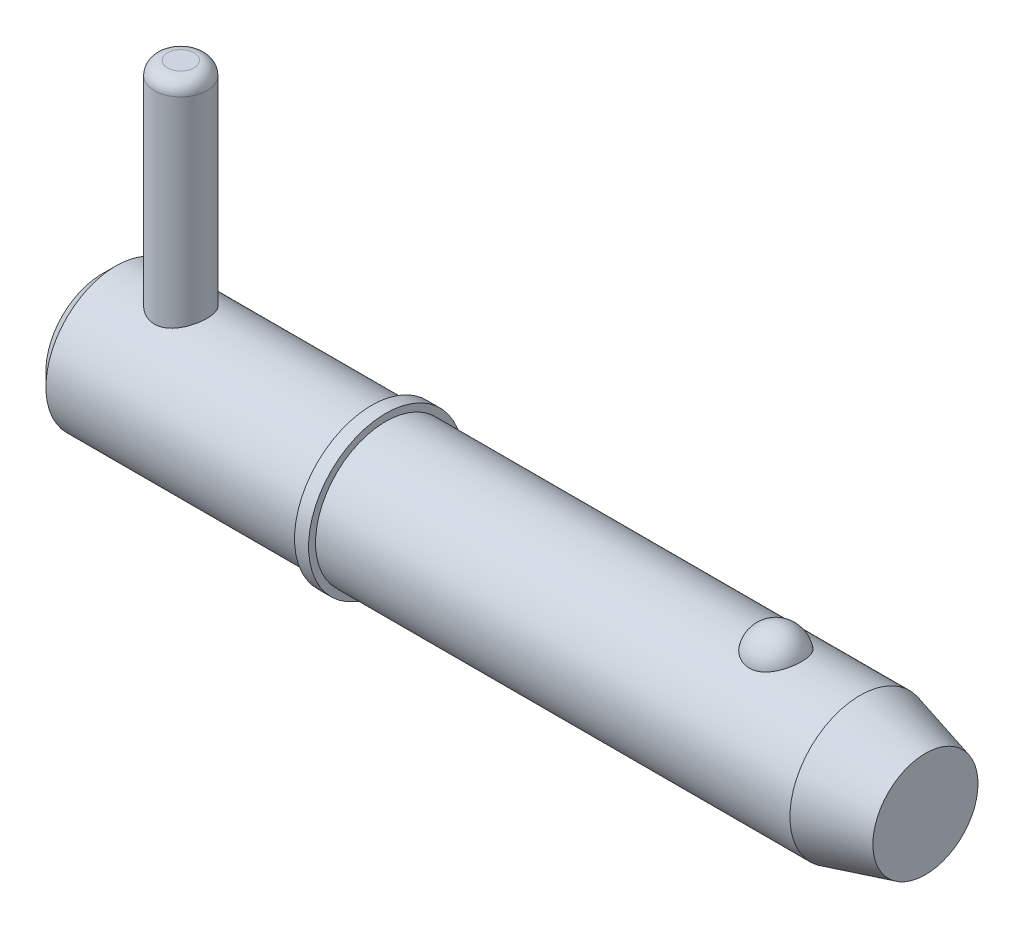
ISO-10303-21;
HEADER;
FILE_DESCRIPTION(('STEP AP214'),'2;1');
FILE_NAME('part.step','',(''),(''),'','','');
FILE_SCHEMA(('AUTOMOTIVE_DESIGN { 1 0 10303 214 1 1 1 1 }'));
ENDSEC;
DATA;
#1=APPLICATION_CONTEXT('core data for automotive mechanical design processes');
#2=APPLICATION_PROTOCOL_DEFINITION('international standard','automotive_design',2000,#1);
#3=PRODUCT_CONTEXT('',#1,'mechanical');
#4=PRODUCT('Part','Part','',(#3));
#5=PRODUCT_RELATED_PRODUCT_CATEGORY('part','',(#4));
#6=PRODUCT_DEFINITION_FORMATION('','',#4);
#7=PRODUCT_DEFINITION_CONTEXT('part definition',#1,'design');
#8=PRODUCT_DEFINITION('design','',#6,#7);
#9=PRODUCT_DEFINITION_SHAPE('','',#8);
#10=(LENGTH_UNIT() NAMED_UNIT(*) SI_UNIT(.MILLI.,.METRE.));
#11=(NAMED_UNIT(*) PLANE_ANGLE_UNIT() SI_UNIT($,.RADIAN.));
#12=(NAMED_UNIT(*) SI_UNIT($,.STERADIAN.) SOLID_ANGLE_UNIT());
#13=UNCERTAINTY_MEASURE_WITH_UNIT(LENGTH_MEASURE(1.E-05),#10,'distance_accuracy_value','');
#14=(GEOMETRIC_REPRESENTATION_CONTEXT(3) GLOBAL_UNCERTAINTY_ASSIGNED_CONTEXT((#13)) GLOBAL_UNIT_ASSIGNED_CONTEXT((#10,
#11,#12)) REPRESENTATION_CONTEXT('',''));
#15=CARTESIAN_POINT('',(0.,0.,0.));
#16=DIRECTION('',(0.,0.,1.));
#17=DIRECTION('',(1.,0.,0.));
#18=AXIS2_PLACEMENT_3D('',#15,#16,#17);
#19=CARTESIAN_POINT('',(7.14,25.4,0.));
#20=DIRECTION('',(0.,-1.,0.));
#21=DIRECTION('',(0.,0.,-1.));
#22=AXIS2_PLACEMENT_3D('',#19,#20,#21);
#23=CYLINDRICAL_SURFACE('',#22,2.38);
#24=CARTESIAN_POINT('',(7.14,-5.16,0.));
#25=DIRECTION('',(0.,1.,0.));
#26=DIRECTION('',(0.,0.,1.));
#27=AXIS2_PLACEMENT_3D('',#24,#25,#26);
#28=CIRCLE('',#27,2.38);
#29=CARTESIAN_POINT('',(7.14,-5.16,2.38));
#30=VERTEX_POINT('',#29);
#31=EDGE_CURVE('P0_E25',#30,#30,#28,.T.);
#32=ORIENTED_EDGE('',*,*,#31,.T.);
#33=EDGE_LOOP('',(#32));
#34=FACE_BOUND('',#33,.T.);
#35=CARTESIAN_POINT('',(7.14,24.21,0.));
#36=DIRECTION('',(0.,1.,0.));
#37=DIRECTION('',(0.,0.,1.));
#38=AXIS2_PLACEMENT_3D('',#35,#36,#37);
#39=CIRCLE('',#38,2.38);
#40=CARTESIAN_POINT('',(7.14,24.21,2.38));
#41=VERTEX_POINT('',#40);
#42=EDGE_CURVE('P0_E29',#41,#41,#39,.F.);
#43=ORIENTED_EDGE('',*,*,#42,.T.);
#44=EDGE_LOOP('',(#43));
#45=FACE_BOUND('',#44,.T.);
#46=ADVANCED_FACE('P0_F14',(#34,#45),#23,.T.);
#47=CARTESIAN_POINT('',(7.14,25.4,0.));
#48=DIRECTION('',(0.,1.,0.));
#49=DIRECTION('',(0.,0.,1.));
#50=AXIS2_PLACEMENT_3D('',#47,#48,#49);
#51=PLANE('',#50);
#52=CARTESIAN_POINT('',(7.14,25.4,0.));
#53=DIRECTION('',(0.,1.,0.));
#54=DIRECTION('',(0.,0.,1.));
#55=AXIS2_PLACEMENT_3D('',#52,#53,#54);
#56=CIRCLE('',#55,1.19);
#57=CARTESIAN_POINT('',(7.14,25.4,1.19));
#58=VERTEX_POINT('',#57);
#59=EDGE_CURVE('P0_E10',#58,#58,#56,.T.);
#60=ORIENTED_EDGE('',*,*,#59,.T.);
#61=EDGE_LOOP('',(#60));
#62=FACE_BOUND('',#61,.T.);
#63=ADVANCED_FACE('P0_F46',(#62),#51,.T.);
#64=CARTESIAN_POINT('',(7.14,-6.35,0.));
#65=DIRECTION('',(0.,1.,0.));
#66=DIRECTION('',(0.,0.,1.));
#67=AXIS2_PLACEMENT_3D('',#64,#65,#66);
#68=PLANE('',#67);
#69=CARTESIAN_POINT('',(7.14,-6.35,0.));
#70=DIRECTION('',(0.,1.,0.));
#71=DIRECTION('',(0.,0.,1.));
#72=AXIS2_PLACEMENT_3D('',#69,#70,#71);
#73=CIRCLE('',#72,1.19);
#74=CARTESIAN_POINT('',(7.14,-6.35,1.19));
#75=VERTEX_POINT('',#74);
#76=EDGE_CURVE('P0_E21',#75,#75,#73,.F.);
#77=ORIENTED_EDGE('',*,*,#76,.T.);
#78=EDGE_LOOP('',(#77));
#79=FACE_BOUND('',#78,.T.);
#80=ADVANCED_FACE('P0_F43',(#79),#68,.F.);
#81=CARTESIAN_POINT('',(7.14,-5.16,0.));
#82=DIRECTION('',(0.,1.,0.));
#83=DIRECTION('',(0.,0.,1.));
#84=AXIS2_PLACEMENT_3D('',#81,#82,#83);
#85=DEGENERATE_TOROIDAL_SURFACE('',#84,1.19,1.19,.T.);
#86=ORIENTED_EDGE('',*,*,#76,.F.);
#87=EDGE_LOOP('',(#86));
#88=FACE_BOUND('',#87,.T.);
#89=ORIENTED_EDGE('',*,*,#31,.F.);
#90=EDGE_LOOP('',(#89));
#91=FACE_BOUND('',#90,.T.);
#92=ADVANCED_FACE('P0_F38',(#88,#91),#85,.T.);
#93=CARTESIAN_POINT('',(7.14,24.21,0.));
#94=DIRECTION('',(0.,1.,0.));
#95=DIRECTION('',(0.,0.,1.));
#96=AXIS2_PLACEMENT_3D('',#93,#94,#95);
#97=DEGENERATE_TOROIDAL_SURFACE('',#96,1.19,1.19,.T.);
#98=ORIENTED_EDGE('',*,*,#42,.F.);
#99=EDGE_LOOP('',(#98));
#100=FACE_BOUND('',#99,.T.);
#101=ORIENTED_EDGE('',*,*,#59,.F.);
#102=EDGE_LOOP('',(#101));
#103=FACE_BOUND('',#102,.T.);
#104=ADVANCED_FACE('P0_F16',(#100,#103),#97,.T.);
#105=CLOSED_SHELL('',(#46,#63,#80,#92,#104));
#106=MANIFOLD_SOLID_BREP('P0_B1',#105);
#107=CARTESIAN_POINT('',(0.,0.,0.));
#108=DIRECTION('',(1.,0.,0.));
#109=DIRECTION('',(0.,0.,-1.));
#110=AXIS2_PLACEMENT_3D('',#107,#108,#109);
#111=CYLINDRICAL_SURFACE('',#110,6.35);
#112=CARTESIAN_POINT('',(68.6753693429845,0.,0.));
#113=DIRECTION('',(1.,0.,0.));
#114=DIRECTION('',(0.,0.,-1.));
#115=AXIS2_PLACEMENT_3D('',#112,#113,#114);
#116=CIRCLE('',#115,6.35);
#117=CARTESIAN_POINT('',(68.6753693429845,0.,-6.35));
#118=VERTEX_POINT('',#117);
#119=EDGE_CURVE('P1_E81',#118,#118,#116,.T.);
#120=ORIENTED_EDGE('',*,*,#119,.F.);
#121=EDGE_LOOP('',(#120));
#122=FACE_BOUND('',#121,.T.);
#123=CARTESIAN_POINT('',(25.7,0.,0.));
#124=DIRECTION('',(1.,0.,0.));
#125=DIRECTION('',(0.,0.,-1.));
#126=AXIS2_PLACEMENT_3D('',#123,#124,#125);
#127=CIRCLE('',#126,6.35);
#128=CARTESIAN_POINT('',(25.7,0.,-6.35));
#129=VERTEX_POINT('',#128);
#130=EDGE_CURVE('P1_E85',#129,#129,#127,.T.);
#131=ORIENTED_EDGE('',*,*,#130,.T.);
#132=EDGE_LOOP('',(#131));
#133=FACE_BOUND('',#132,.T.);
#134=CARTESIAN_POINT('',(61.0500214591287,5.87502187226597,2.40969251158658));
#135=CARTESIAN_POINT('',(60.9250305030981,5.87501645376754,2.40969773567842));
#136=CARTESIAN_POINT('',(60.8000806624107,5.87916061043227,2.39967292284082));
#137=CARTESIAN_POINT('',(60.5539091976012,5.89523112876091,2.35991730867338));
#138=CARTESIAN_POINT('',(60.4326863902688,5.90715499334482,2.33019283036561));
#139=CARTESIAN_POINT('',(60.1975170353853,5.93739567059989,2.25201402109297));
#140=CARTESIAN_POINT('',(60.0835602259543,5.95570321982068,2.2035868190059));
#141=CARTESIAN_POINT('',(59.86557352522,5.99672067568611,2.08937987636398));
#142=CARTESIAN_POINT('',(59.7615457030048,6.01943149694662,2.02359652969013));
#143=CARTESIAN_POINT('',(59.5629437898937,6.06760647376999,1.8742896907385));
#144=CARTESIAN_POINT('',(59.4687268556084,6.09313095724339,1.79031110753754));
#145=CARTESIAN_POINT('',(59.2952557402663,6.14375873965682,1.60800178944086));
#146=CARTESIAN_POINT('',(59.2160043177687,6.16886196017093,1.50966841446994));
#147=CARTESIAN_POINT('',(59.0708457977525,6.21724600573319,1.29645884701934));
#148=CARTESIAN_POINT('',(59.0056885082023,6.24039621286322,1.18104158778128));
#149=CARTESIAN_POINT('',(58.8947035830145,6.28117277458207,0.94035184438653));
#150=CARTESIAN_POINT('',(58.8488776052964,6.29879865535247,0.815078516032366));
#151=CARTESIAN_POINT('',(58.7770234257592,6.32692073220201,0.556494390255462));
#152=CARTESIAN_POINT('',(58.751249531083,6.33732517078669,0.423102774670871));
#153=CARTESIAN_POINT('',(58.7209885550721,6.34957673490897,0.153542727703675));
#154=CARTESIAN_POINT('',(58.7165009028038,6.35142408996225,0.0173743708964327));
#155=CARTESIAN_POINT('',(58.7288655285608,6.34638925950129,-0.253036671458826));
#156=CARTESIAN_POINT('',(58.7455949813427,6.33955731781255,-0.387285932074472));
#157=CARTESIAN_POINT('',(58.799843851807,6.31794129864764,-0.65085123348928));
#158=CARTESIAN_POINT('',(58.8373636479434,6.30315707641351,-0.780167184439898));
#159=CARTESIAN_POINT('',(58.932500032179,6.26711642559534,-1.03041949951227));
#160=CARTESIAN_POINT('',(58.990143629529,6.24585130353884,-1.1513443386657));
#161=CARTESIAN_POINT('',(59.1243522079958,6.19905619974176,-1.38129800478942));
#162=CARTESIAN_POINT('',(59.2009187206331,6.17352587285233,-1.49032586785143));
#163=CARTESIAN_POINT('',(59.3717538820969,6.12080227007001,-1.69393164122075));
#164=CARTESIAN_POINT('',(59.4661008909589,6.09360200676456,-1.78844209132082));
#165=CARTESIAN_POINT('',(59.6701196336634,6.0407043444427,-1.95970536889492));
#166=CARTESIAN_POINT('',(59.7797900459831,6.01500681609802,-2.03645972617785));
#167=CARTESIAN_POINT('',(60.0091876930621,5.96867714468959,-2.16845644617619));
#168=CARTESIAN_POINT('',(60.1286522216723,5.94794910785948,-2.22412062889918));
#169=CARTESIAN_POINT('',(60.3762188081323,5.91340580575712,-2.31440992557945));
#170=CARTESIAN_POINT('',(60.5043175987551,5.8995879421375,-2.34904294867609));
#171=CARTESIAN_POINT('',(60.758582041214,5.88111049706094,-2.39491590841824));
#172=CARTESIAN_POINT('',(60.8845207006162,5.876025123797,-2.40724512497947));
#173=CARTESIAN_POINT('',(61.1367867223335,5.87428980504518,-2.41147867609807));
#174=CARTESIAN_POINT('',(61.263114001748,5.87763817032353,-2.40338710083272));
#175=CARTESIAN_POINT('',(61.5084170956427,5.89212921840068,-2.36762715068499));
#176=CARTESIAN_POINT('',(61.6274992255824,5.90302431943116,-2.34058030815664));
#177=CARTESIAN_POINT('',(61.8592447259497,5.93113752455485,-2.26839066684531));
#178=CARTESIAN_POINT('',(61.9719075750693,5.94835614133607,-2.22324640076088));
#179=CARTESIAN_POINT('',(62.1904009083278,5.98773016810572,-2.11493806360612));
#180=CARTESIAN_POINT('',(62.296028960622,6.00998499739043,-2.05140269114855));
#181=CARTESIAN_POINT('',(62.4953006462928,6.05690144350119,-1.90842705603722));
#182=CARTESIAN_POINT('',(62.5889415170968,6.08156361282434,-1.82898313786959));
#183=CARTESIAN_POINT('',(62.7666754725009,6.13211715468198,-1.65182429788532));
#184=CARTESIAN_POINT('',(62.850055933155,6.15800825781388,-1.55339381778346));
#185=CARTESIAN_POINT('',(62.9997900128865,6.20712834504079,-1.34374214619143));
#186=CARTESIAN_POINT('',(63.0661405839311,6.23035685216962,-1.23251867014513));
#187=CARTESIAN_POINT('',(63.1823455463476,6.27251177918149,-0.99644720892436));
#188=CARTESIAN_POINT('',(63.2316072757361,6.29127762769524,-0.871278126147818));
#189=CARTESIAN_POINT('',(63.3096142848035,6.3215862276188,-0.613870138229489));
#190=CARTESIAN_POINT('',(63.3383593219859,6.33312889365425,-0.48163114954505));
#191=CARTESIAN_POINT('',(63.3747705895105,6.34782349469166,-0.213672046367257));
#192=CARTESIAN_POINT('',(63.3824134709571,6.35096613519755,-0.0779482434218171));
#193=CARTESIAN_POINT('',(63.3763951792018,6.34851322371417,0.19294395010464));
#194=CARTESIAN_POINT('',(63.3627343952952,6.3429178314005,0.328112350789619));
#195=CARTESIAN_POINT('',(63.3145036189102,6.32360512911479,0.593406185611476));
#196=CARTESIAN_POINT('',(63.2800313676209,6.30992579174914,0.723552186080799));
#197=CARTESIAN_POINT('',(63.1909539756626,6.27586325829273,0.975834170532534));
#198=CARTESIAN_POINT('',(63.1363476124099,6.25547965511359,1.09796966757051));
#199=CARTESIAN_POINT('',(63.0077587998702,6.20998183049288,1.33148921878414));
#200=CARTESIAN_POINT('',(62.9336742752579,6.18484288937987,1.44281227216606));
#201=CARTESIAN_POINT('',(62.7678204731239,6.13258735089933,1.65087683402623));
#202=CARTESIAN_POINT('',(62.6760515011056,6.10547078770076,1.74761859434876));
#203=CARTESIAN_POINT('',(62.4771839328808,6.05235879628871,1.92350926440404));
#204=CARTESIAN_POINT('',(62.370133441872,6.02636017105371,2.00271146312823));
#205=CARTESIAN_POINT('',(62.1431384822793,5.97843747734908,2.1415415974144));
#206=CARTESIAN_POINT('',(62.023191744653,5.95651412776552,2.20116608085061));
#207=CARTESIAN_POINT('',(61.7645236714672,5.91812106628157,2.30250570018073));
#208=CARTESIAN_POINT('',(61.6250698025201,5.90217533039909,2.34256795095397));
#209=CARTESIAN_POINT('',(61.3403974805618,5.88063128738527,2.39615214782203));
#210=CARTESIAN_POINT('',(61.1951817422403,5.87502816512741,2.4096864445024));
#211=CARTESIAN_POINT('',(61.0500214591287,5.87502187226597,2.40969251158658));
#212=B_SPLINE_CURVE_WITH_KNOTS('',3,(#134,#135,#136,#137,#138,#139,#140,#141,#142,#143,#144,
#145,#146,#147,#148,#149,#150,#151,#152,#153,#154,#155,#156,#157,#158,#159,#160,#161,#162,#163,
#164,#165,#166,#167,#168,#169,#170,#171,#172,#173,#174,#175,#176,#177,#178,#179,#180,#181,#182,
#183,#184,#185,#186,#187,#188,#189,#190,#191,#192,#193,#194,#195,#196,#197,#198,#199,#200,#201,
#202,#203,#204,#205,#206,#207,#208,#209,#210,#211),.UNSPECIFIED.,.T.,.F.,(4,2,2,2,2,2,2,2,2,2,2,
2,2,2,2,2,2,2,2,2,2,2,2,2,2,2,2,2,2,2,2,2,2,2,2,2,2,2,4),(0.,0.374440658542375,
0.748761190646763,1.12254078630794,1.49639810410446,1.8809887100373,2.2656501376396,
2.66741104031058,3.06920639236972,3.47601794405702,3.88281858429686,4.28727498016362,
4.69173873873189,5.09674745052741,5.50178895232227,5.90865911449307,6.31549420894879,
6.71369855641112,7.11175305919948,7.48978077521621,7.86773278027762,8.23383886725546,
8.59997464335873,8.97409044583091,9.34829231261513,9.74122667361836,10.1342313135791,
10.5397522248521,10.945277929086,11.3512521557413,11.7572189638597,12.1612938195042,
12.5653932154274,12.9716540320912,13.3779078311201,13.7829098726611,14.1879832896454,
14.6230486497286,15.0579114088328),.UNSPECIFIED.);
#213=CARTESIAN_POINT('',(61.0500214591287,5.87502187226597,2.40969251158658));
#214=VERTEX_POINT('',#213);
#215=EDGE_CURVE('P1_E35',#214,#214,#212,.T.);
#216=ORIENTED_EDGE('',*,*,#215,.T.);
#217=EDGE_LOOP('',(#216));
#218=FACE_BOUND('',#217,.T.);
#219=ADVANCED_FACE('P1_F13',(#122,#133,#218),#111,.T.);
#220=CARTESIAN_POINT('',(0.,0.,0.));
#221=DIRECTION('',(-1.,0.,0.));
#222=DIRECTION('',(0.,0.,1.));
#223=AXIS2_PLACEMENT_3D('',#220,#221,#222);
#224=PLANE('',#223);
#225=CARTESIAN_POINT('',(0.,0.,0.));
#226=DIRECTION('',(1.,0.,0.));
#227=DIRECTION('',(0.,0.,-1.));
#228=AXIS2_PLACEMENT_3D('',#225,#226,#227);
#229=CIRCLE('',#228,5.08);
#230=CARTESIAN_POINT('',(0.,0.,-5.08));
#231=VERTEX_POINT('',#230);
#232=EDGE_CURVE('P1_E9',#231,#231,#229,.T.);
#233=ORIENTED_EDGE('',*,*,#232,.F.);
#234=EDGE_LOOP('',(#233));
#235=FACE_BOUND('',#234,.T.);
#236=ADVANCED_FACE('P1_F15',(#235),#224,.T.);
#237=CARTESIAN_POINT('',(1.27,0.,0.));
#238=DIRECTION('',(1.,0.,0.));
#239=DIRECTION('',(0.,0.,-1.));
#240=AXIS2_PLACEMENT_3D('',#237,#238,#239);
#241=CONICAL_SURFACE('',#240,6.35,0.78539816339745);
#242=ORIENTED_EDGE('',*,*,#232,.T.);
#243=EDGE_LOOP('',(#242));
#244=FACE_BOUND('',#243,.T.);
#245=CARTESIAN_POINT('',(1.27,0.,0.));
#246=DIRECTION('',(1.,0.,0.));
#247=DIRECTION('',(0.,0.,-1.));
#248=AXIS2_PLACEMENT_3D('',#245,#246,#247);
#249=CIRCLE('',#248,6.35);
#250=CARTESIAN_POINT('',(1.27,0.,-6.35));
#251=VERTEX_POINT('',#250);
#252=EDGE_CURVE('P1_E26',#251,#251,#249,.T.);
#253=ORIENTED_EDGE('',*,*,#252,.F.);
#254=EDGE_LOOP('',(#253));
#255=FACE_BOUND('',#254,.T.);
#256=ADVANCED_FACE('P1_F77',(#244,#255),#241,.T.);
#257=CARTESIAN_POINT('',(0.,0.,0.));
#258=DIRECTION('',(1.,0.,0.));
#259=DIRECTION('',(0.,0.,-1.));
#260=AXIS2_PLACEMENT_3D('',#257,#258,#259);
#261=CYLINDRICAL_SURFACE('',#260,6.35);
#262=CARTESIAN_POINT('',(7.14,-5.88711304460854,2.38));
#263=CARTESIAN_POINT('',(7.01146258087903,-5.88710856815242,2.38000480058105));
#264=CARTESIAN_POINT('',(6.88295682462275,-5.89136840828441,2.36955244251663));
#265=CARTESIAN_POINT('',(6.62981934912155,-5.90782785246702,2.32820953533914));
#266=CARTESIAN_POINT('',(6.50518751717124,-5.92002722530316,2.29731958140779));
#267=CARTESIAN_POINT('',(6.26352403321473,-5.95079384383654,2.21639366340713));
#268=CARTESIAN_POINT('',(6.14647496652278,-5.96934583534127,2.16640353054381));
#269=CARTESIAN_POINT('',(5.92237941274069,-6.01070278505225,2.04885862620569));
#270=CARTESIAN_POINT('',(5.81533593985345,-6.03350901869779,1.98129858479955));
#271=CARTESIAN_POINT('',(5.60897525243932,-6.08207341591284,1.82693902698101));
#272=CARTESIAN_POINT('',(5.51022503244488,-6.10791836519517,1.73940861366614));
#273=CARTESIAN_POINT('',(5.32840561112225,-6.15892405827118,1.54914379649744));
#274=CARTESIAN_POINT('',(5.24533975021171,-6.1840846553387,1.44640616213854));
#275=CARTESIAN_POINT('',(5.09451639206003,-6.23191821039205,1.22434014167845));
#276=CARTESIAN_POINT('',(5.02737511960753,-6.25447755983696,1.10456656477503));
#277=CARTESIAN_POINT('',(4.91443001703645,-6.2935236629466,0.854429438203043));
#278=CARTESIAN_POINT('',(4.86861879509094,-6.31001251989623,0.724069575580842));
#279=CARTESIAN_POINT('',(4.80162253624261,-6.33444370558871,0.46242122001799));
#280=CARTESIAN_POINT('',(4.77946137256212,-6.34272370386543,0.331414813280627));
#281=CARTESIAN_POINT('',(4.75726677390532,-6.35101600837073,0.0672982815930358));
#282=CARTESIAN_POINT('',(4.75722615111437,-6.35103100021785,-0.0658111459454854));
#283=CARTESIAN_POINT('',(4.77870510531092,-6.3430064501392,-0.323358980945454));
#284=CARTESIAN_POINT('',(4.79915922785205,-6.33536494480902,-0.447900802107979));
#285=CARTESIAN_POINT('',(4.85925493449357,-6.31340794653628,-0.69163609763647));
#286=CARTESIAN_POINT('',(4.89889787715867,-6.29909198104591,-0.810829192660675));
#287=CARTESIAN_POINT('',(4.9967414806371,-6.26494471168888,-1.04254212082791));
#288=CARTESIAN_POINT('',(5.05520370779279,-6.24503620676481,-1.1549396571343));
#289=CARTESIAN_POINT('',(5.1887948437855,-6.20171869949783,-1.3686079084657));
#290=CARTESIAN_POINT('',(5.26392912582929,-6.17830856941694,-1.46987502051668));
#291=CARTESIAN_POINT('',(5.43386591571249,-6.12878580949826,-1.66468415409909));
#292=CARTESIAN_POINT('',(5.52956139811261,-6.10259519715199,-1.75742857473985));
#293=CARTESIAN_POINT('',(5.73530435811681,-6.05155777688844,-1.92585331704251));
#294=CARTESIAN_POINT('',(5.84535542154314,-6.02671130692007,-2.00152936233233));
#295=CARTESIAN_POINT('',(6.07982989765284,-5.98068420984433,-2.13519109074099));
#296=CARTESIAN_POINT('',(6.20451768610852,-5.95959698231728,-2.19274775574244));
#297=CARTESIAN_POINT('',(6.4628145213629,-5.92455622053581,-2.28574558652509));
#298=CARTESIAN_POINT('',(6.59641856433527,-5.91059872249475,-2.32119904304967));
#299=CARTESIAN_POINT('',(6.86087441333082,-5.8923327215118,-2.36717069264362));
#300=CARTESIAN_POINT('',(6.99147192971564,-5.8875347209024,-2.37895573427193));
#301=CARTESIAN_POINT('',(7.25283805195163,-5.88674545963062,-2.38091046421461));
#302=CARTESIAN_POINT('',(7.38360660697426,-5.89075200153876,-2.37108554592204));
#303=CARTESIAN_POINT('',(7.63510696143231,-5.90662331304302,-2.33124781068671));
#304=CARTESIAN_POINT('',(7.75602069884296,-5.91810660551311,-2.30221396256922));
#305=CARTESIAN_POINT('',(7.99120505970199,-5.94718527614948,-2.22601401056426));
#306=CARTESIAN_POINT('',(8.10547431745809,-5.96478190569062,-2.17884419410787));
#307=CARTESIAN_POINT('',(8.32888632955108,-6.00491533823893,-2.06572311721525));
#308=CARTESIAN_POINT('',(8.43767672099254,-6.02761250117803,-1.99913452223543));
#309=CARTESIAN_POINT('',(8.6429894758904,-6.07511988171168,-1.84974438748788));
#310=CARTESIAN_POINT('',(8.73950733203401,-6.09993087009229,-1.76693691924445));
#311=CARTESIAN_POINT('',(8.9238741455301,-6.1507686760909,-1.58125563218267));
#312=CARTESIAN_POINT('',(9.01078732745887,-6.17677301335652,-1.47744327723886));
#313=CARTESIAN_POINT('',(9.16607127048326,-6.22556172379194,-1.25606967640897));
#314=CARTESIAN_POINT('',(9.23444197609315,-6.24834608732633,-1.13850838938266));
#315=CARTESIAN_POINT('',(9.3502493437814,-6.28811144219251,-0.893050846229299));
#316=CARTESIAN_POINT('',(9.39775808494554,-6.30511236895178,-0.765192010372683));
#317=CARTESIAN_POINT('',(9.47032640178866,-6.33145833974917,-0.502514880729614));
#318=CARTESIAN_POINT('',(9.49539651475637,-6.34080697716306,-0.367699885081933));
#319=CARTESIAN_POINT('',(9.52124059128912,-6.35045496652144,-0.103396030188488));
#320=CARTESIAN_POINT('',(9.52334421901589,-6.35124952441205,0.025945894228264));
#321=CARTESIAN_POINT('',(9.50661518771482,-6.34499064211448,0.283061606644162));
#322=CARTESIAN_POINT('',(9.48778504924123,-6.33793814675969,0.410835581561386));
#323=CARTESIAN_POINT('',(9.43065630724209,-6.31700307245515,0.658028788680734));
#324=CARTESIAN_POINT('',(9.39284291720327,-6.30329098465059,0.7775756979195));
#325=CARTESIAN_POINT('',(9.29930406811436,-6.27046903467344,1.00863789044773));
#326=CARTESIAN_POINT('',(9.2435752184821,-6.25135815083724,1.12015164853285));
#327=CARTESIAN_POINT('',(9.11312349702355,-6.20865254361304,1.33711407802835));
#328=CARTESIAN_POINT('',(9.03770094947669,-6.18490316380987,1.44211105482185));
#329=CARTESIAN_POINT('',(8.87110640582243,-6.13583718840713,1.63836897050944));
#330=CARTESIAN_POINT('',(8.77992879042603,-6.11052003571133,1.72962498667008));
#331=CARTESIAN_POINT('',(8.57869799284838,-6.05953829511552,1.90076098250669));
#332=CARTESIAN_POINT('',(8.46790320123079,-6.03392573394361,1.97978778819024));
#333=CARTESIAN_POINT('',(8.23379693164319,-5.98676607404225,2.11813466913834));
#334=CARTESIAN_POINT('',(8.11048418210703,-5.9652193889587,2.17745273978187));
#335=CARTESIAN_POINT('',(7.84900037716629,-5.92818393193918,2.27641807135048));
#336=CARTESIAN_POINT('',(7.71041678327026,-5.91299857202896,2.31510015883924));
#337=CARTESIAN_POINT('',(7.42787316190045,-5.89246887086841,2.36688002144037));
#338=CARTESIAN_POINT('',(7.28391673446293,-5.88711805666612,2.37999462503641));
#339=CARTESIAN_POINT('',(7.14,-5.88711304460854,2.38));
#340=B_SPLINE_CURVE_WITH_KNOTS('',3,(#262,#263,#264,#265,#266,#267,#268,#269,#270,#271,#272,
#273,#274,#275,#276,#277,#278,#279,#280,#281,#282,#283,#284,#285,#286,#287,#288,#289,#290,#291,
#292,#293,#294,#295,#296,#297,#298,#299,#300,#301,#302,#303,#304,#305,#306,#307,#308,#309,#310,
#311,#312,#313,#314,#315,#316,#317,#318,#319,#320,#321,#322,#323,#324,#325,#326,#327,#328,#329,
#330,#331,#332,#333,#334,#335,#336,#337,#338,#339),.UNSPECIFIED.,.T.,.F.,(4,2,2,2,2,2,2,2,2,2,2,
2,2,2,2,2,2,2,2,2,2,2,2,2,2,2,2,2,2,2,2,2,2,2,2,2,2,2,4),(0.,0.385076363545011,
0.770141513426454,1.15428843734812,1.53855071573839,1.94016118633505,2.3418570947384,
2.75720522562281,3.1724093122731,3.569721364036,3.96690431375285,4.34445758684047,
4.72203759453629,5.10511017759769,5.48830640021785,5.89390240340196,6.29959991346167,
6.71428455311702,7.12873839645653,7.52034494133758,7.91185376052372,8.28480528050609,
8.65783318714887,9.0448340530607,9.43197664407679,9.84363087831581,10.2552863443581,
10.6655081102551,11.0755371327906,11.4616919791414,11.847800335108,12.224507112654,
12.6012852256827,12.9938941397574,13.386643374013,13.8000944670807,14.2135876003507,
14.6450218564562,15.0761720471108),.UNSPECIFIED.);
#341=CARTESIAN_POINT('',(7.14,-5.88711304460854,2.38));
#342=VERTEX_POINT('',#341);
#343=EDGE_CURVE('P1_E17',#342,#342,#340,.T.);
#344=ORIENTED_EDGE('',*,*,#343,.F.);
#345=EDGE_LOOP('',(#344));
#346=FACE_BOUND('',#345,.T.);
#347=CARTESIAN_POINT('',(7.14,5.88711304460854,2.38));
#348=CARTESIAN_POINT('',(7.26853741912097,5.88710856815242,2.38000480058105));
#349=CARTESIAN_POINT('',(7.39704317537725,5.89136840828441,2.36955244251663));
#350=CARTESIAN_POINT('',(7.65018065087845,5.90782785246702,2.32820953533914));
#351=CARTESIAN_POINT('',(7.77481248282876,5.92002722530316,2.29731958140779));
#352=CARTESIAN_POINT('',(8.01647596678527,5.95079384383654,2.21639366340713));
#353=CARTESIAN_POINT('',(8.13352503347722,5.96934583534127,2.16640353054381));
#354=CARTESIAN_POINT('',(8.35762058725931,6.01070278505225,2.04885862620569));
#355=CARTESIAN_POINT('',(8.46466406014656,6.03350901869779,1.98129858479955));
#356=CARTESIAN_POINT('',(8.67102474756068,6.08207341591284,1.82693902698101));
#357=CARTESIAN_POINT('',(8.76977496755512,6.10791836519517,1.73940861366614));
#358=CARTESIAN_POINT('',(8.95159438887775,6.15892405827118,1.54914379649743));
#359=CARTESIAN_POINT('',(9.03466024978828,6.1840846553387,1.44640616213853));
#360=CARTESIAN_POINT('',(9.18548360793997,6.23191821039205,1.22434014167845));
#361=CARTESIAN_POINT('',(9.25262488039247,6.25447755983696,1.10456656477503));
#362=CARTESIAN_POINT('',(9.36556998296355,6.2935236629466,0.854429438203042));
#363=CARTESIAN_POINT('',(9.41138120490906,6.31001251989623,0.72406957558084));
#364=CARTESIAN_POINT('',(9.47837746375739,6.33444370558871,0.462421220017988));
#365=CARTESIAN_POINT('',(9.50053862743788,6.34272370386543,0.331414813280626));
#366=CARTESIAN_POINT('',(9.52273322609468,6.35101600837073,0.0672982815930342));
#367=CARTESIAN_POINT('',(9.52277384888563,6.35103100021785,-0.0658111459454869));
#368=CARTESIAN_POINT('',(9.50129489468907,6.3430064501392,-0.323358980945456));
#369=CARTESIAN_POINT('',(9.48084077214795,6.33536494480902,-0.447900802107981));
#370=CARTESIAN_POINT('',(9.42074506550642,6.31340794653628,-0.691636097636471));
#371=CARTESIAN_POINT('',(9.38110212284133,6.29909198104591,-0.810829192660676));
#372=CARTESIAN_POINT('',(9.2832585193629,6.26494471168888,-1.04254212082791));
#373=CARTESIAN_POINT('',(9.22479629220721,6.24503620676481,-1.1549396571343));
#374=CARTESIAN_POINT('',(9.0912051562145,6.20171869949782,-1.3686079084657));
#375=CARTESIAN_POINT('',(9.0160708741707,6.17830856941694,-1.46987502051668));
#376=CARTESIAN_POINT('',(8.84613408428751,6.12878580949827,-1.66468415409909));
#377=CARTESIAN_POINT('',(8.75043860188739,6.10259519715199,-1.75742857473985));
#378=CARTESIAN_POINT('',(8.54469564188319,6.05155777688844,-1.92585331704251));
#379=CARTESIAN_POINT('',(8.43464457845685,6.02671130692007,-2.00152936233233));
#380=CARTESIAN_POINT('',(8.20017010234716,5.98068420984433,-2.13519109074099));
#381=CARTESIAN_POINT('',(8.07548231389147,5.95959698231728,-2.19274775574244));
#382=CARTESIAN_POINT('',(7.8171854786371,5.9245562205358,-2.28574558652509));
#383=CARTESIAN_POINT('',(7.68358143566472,5.91059872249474,-2.32119904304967));
#384=CARTESIAN_POINT('',(7.41912558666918,5.8923327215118,-2.36717069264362));
#385=CARTESIAN_POINT('',(7.28852807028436,5.8875347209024,-2.37895573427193));
#386=CARTESIAN_POINT('',(7.02716194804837,5.88674545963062,-2.38091046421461));
#387=CARTESIAN_POINT('',(6.89639339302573,5.89075200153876,-2.37108554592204));
#388=CARTESIAN_POINT('',(6.64489303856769,5.90662331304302,-2.33124781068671));
#389=CARTESIAN_POINT('',(6.52397930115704,5.91810660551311,-2.30221396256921));
#390=CARTESIAN_POINT('',(6.288794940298,5.94718527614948,-2.22601401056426));
#391=CARTESIAN_POINT('',(6.17452568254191,5.96478190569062,-2.17884419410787));
#392=CARTESIAN_POINT('',(5.95111367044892,6.00491533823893,-2.06572311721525));
#393=CARTESIAN_POINT('',(5.84232327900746,6.02761250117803,-1.99913452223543));
#394=CARTESIAN_POINT('',(5.6370105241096,6.07511988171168,-1.84974438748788));
#395=CARTESIAN_POINT('',(5.54049266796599,6.09993087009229,-1.76693691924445));
#396=CARTESIAN_POINT('',(5.3561258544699,6.1507686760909,-1.58125563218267));
#397=CARTESIAN_POINT('',(5.26921267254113,6.17677301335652,-1.47744327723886));
#398=CARTESIAN_POINT('',(5.11392872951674,6.22556172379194,-1.25606967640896));
#399=CARTESIAN_POINT('',(5.04555802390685,6.24834608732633,-1.13850838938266));
#400=CARTESIAN_POINT('',(4.9297506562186,6.28811144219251,-0.893050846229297));
#401=CARTESIAN_POINT('',(4.88224191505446,6.30511236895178,-0.76519201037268));
#402=CARTESIAN_POINT('',(4.80967359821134,6.33145833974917,-0.502514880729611));
#403=CARTESIAN_POINT('',(4.78460348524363,6.34080697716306,-0.36769988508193));
#404=CARTESIAN_POINT('',(4.75875940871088,6.35045496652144,-0.103396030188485));
#405=CARTESIAN_POINT('',(4.75665578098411,6.35124952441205,0.025945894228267));
#406=CARTESIAN_POINT('',(4.77338481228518,6.34499064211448,0.283061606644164));
#407=CARTESIAN_POINT('',(4.79221495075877,6.33793814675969,0.410835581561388));
#408=CARTESIAN_POINT('',(4.84934369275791,6.31700307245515,0.658028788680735));
#409=CARTESIAN_POINT('',(4.88715708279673,6.30329098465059,0.777575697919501));
#410=CARTESIAN_POINT('',(4.98069593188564,6.27046903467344,1.00863789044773));
#411=CARTESIAN_POINT('',(5.0364247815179,6.25135815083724,1.12015164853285));
#412=CARTESIAN_POINT('',(5.16687650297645,6.20865254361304,1.33711407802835));
#413=CARTESIAN_POINT('',(5.24229905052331,6.18490316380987,1.44211105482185));
#414=CARTESIAN_POINT('',(5.40889359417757,6.13583718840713,1.63836897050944));
#415=CARTESIAN_POINT('',(5.50007120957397,6.11052003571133,1.72962498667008));
#416=CARTESIAN_POINT('',(5.70130200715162,6.05953829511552,1.90076098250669));
#417=CARTESIAN_POINT('',(5.81209679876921,6.03392573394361,1.97978778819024));
#418=CARTESIAN_POINT('',(6.04620306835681,5.98676607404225,2.11813466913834));
#419=CARTESIAN_POINT('',(6.16951581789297,5.9652193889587,2.17745273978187));
#420=CARTESIAN_POINT('',(6.43099962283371,5.92818393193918,2.27641807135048));
#421=CARTESIAN_POINT('',(6.56958321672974,5.91299857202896,2.31510015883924));
#422=CARTESIAN_POINT('',(6.85212683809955,5.89246887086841,2.36688002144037));
#423=CARTESIAN_POINT('',(6.99608326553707,5.88711805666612,2.37999462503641));
#424=CARTESIAN_POINT('',(7.14,5.88711304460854,2.38));
#425=B_SPLINE_CURVE_WITH_KNOTS('',3,(#347,#348,#349,#350,#351,#352,#353,#354,#355,#356,#357,
#358,#359,#360,#361,#362,#363,#364,#365,#366,#367,#368,#369,#370,#371,#372,#373,#374,#375,#376,
#377,#378,#379,#380,#381,#382,#383,#384,#385,#386,#387,#388,#389,#390,#391,#392,#393,#394,#395,
#396,#397,#398,#399,#400,#401,#402,#403,#404,#405,#406,#407,#408,#409,#410,#411,#412,#413,#414,
#415,#416,#417,#418,#419,#420,#421,#422,#423,#424),.UNSPECIFIED.,.T.,.F.,(4,2,2,2,2,2,2,2,2,2,2,
2,2,2,2,2,2,2,2,2,2,2,2,2,2,2,2,2,2,2,2,2,2,2,2,2,2,2,4),(0.,0.385076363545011,
0.770141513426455,1.15428843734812,1.53855071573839,1.94016118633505,2.3418570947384,
2.75720522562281,3.1724093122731,3.56972136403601,3.96690431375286,4.34445758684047,
4.72203759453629,5.10511017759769,5.48830640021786,5.89390240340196,6.29959991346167,
6.71428455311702,7.12873839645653,7.52034494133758,7.91185376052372,8.2848052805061,
8.65783318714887,9.0448340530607,9.43197664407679,9.84363087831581,10.2552863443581,
10.6655081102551,11.0755371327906,11.4616919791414,11.847800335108,12.2245071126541,
12.6012852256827,12.9938941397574,13.386643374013,13.8000944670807,14.2135876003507,
14.6450218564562,15.0761720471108),.UNSPECIFIED.);
#426=CARTESIAN_POINT('',(7.14,5.88711304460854,2.38));
#427=VERTEX_POINT('',#426);
#428=EDGE_CURVE('P1_E43',#427,#427,#425,.T.);
#429=ORIENTED_EDGE('',*,*,#428,.F.);
#430=EDGE_LOOP('',(#429));
#431=FACE_BOUND('',#430,.T.);
#432=ORIENTED_EDGE('',*,*,#252,.T.);
#433=EDGE_LOOP('',(#432));
#434=FACE_BOUND('',#433,.T.);
#435=CARTESIAN_POINT('',(24.43,0.,0.));
#436=DIRECTION('',(1.,0.,0.));
#437=DIRECTION('',(0.,0.,-1.));
#438=AXIS2_PLACEMENT_3D('',#435,#436,#437);
#439=CIRCLE('',#438,6.35);
#440=CARTESIAN_POINT('',(24.43,0.,-6.35));
#441=VERTEX_POINT('',#440);
#442=EDGE_CURVE('P1_E31',#441,#441,#439,.T.);
#443=ORIENTED_EDGE('',*,*,#442,.F.);
#444=EDGE_LOOP('',(#443));
#445=FACE_BOUND('',#444,.T.);
#446=ADVANCED_FACE('P1_F103',(#346,#431,#434,#445),#261,.T.);
#447=CARTESIAN_POINT('',(24.43,6.35,0.));
#448=DIRECTION('',(-1.,0.,0.));
#449=DIRECTION('',(0.,0.,1.));
#450=AXIS2_PLACEMENT_3D('',#447,#448,#449);
#451=PLANE('',#450);
#452=ORIENTED_EDGE('',*,*,#442,.T.);
#453=EDGE_LOOP('',(#452));
#454=FACE_BOUND('',#453,.T.);
#455=CARTESIAN_POINT('',(24.43,0.,0.));
#456=DIRECTION('',(1.,0.,0.));
#457=DIRECTION('',(0.,0.,-1.));
#458=AXIS2_PLACEMENT_3D('',#455,#456,#457);
#459=CIRCLE('',#458,6.985);
#460=CARTESIAN_POINT('',(24.43,0.,-6.985));
#461=VERTEX_POINT('',#460);
#462=EDGE_CURVE('P1_E91',#461,#461,#459,.T.);
#463=ORIENTED_EDGE('',*,*,#462,.F.);
#464=EDGE_LOOP('',(#463));
#465=FACE_BOUND('',#464,.T.);
#466=ADVANCED_FACE('P1_F100',(#454,#465),#451,.T.);
#467=CARTESIAN_POINT('',(0.,0.,0.));
#468=DIRECTION('',(1.,0.,0.));
#469=DIRECTION('',(0.,0.,-1.));
#470=AXIS2_PLACEMENT_3D('',#467,#468,#469);
#471=CYLINDRICAL_SURFACE('',#470,6.985);
#472=ORIENTED_EDGE('',*,*,#462,.T.);
#473=EDGE_LOOP('',(#472));
#474=FACE_BOUND('',#473,.T.);
#475=CARTESIAN_POINT('',(25.7,0.,0.));
#476=DIRECTION('',(1.,0.,0.));
#477=DIRECTION('',(0.,0.,-1.));
#478=AXIS2_PLACEMENT_3D('',#475,#476,#477);
#479=CIRCLE('',#478,6.985);
#480=CARTESIAN_POINT('',(25.7,0.,-6.985));
#481=VERTEX_POINT('',#480);
#482=EDGE_CURVE('P1_E88',#481,#481,#479,.T.);
#483=ORIENTED_EDGE('',*,*,#482,.F.);
#484=EDGE_LOOP('',(#483));
#485=FACE_BOUND('',#484,.T.);
#486=ADVANCED_FACE('P1_F68',(#474,#485),#471,.T.);
#487=CARTESIAN_POINT('',(25.7,6.985,0.));
#488=DIRECTION('',(1.,0.,0.));
#489=DIRECTION('',(0.,0.,-1.));
#490=AXIS2_PLACEMENT_3D('',#487,#488,#489);
#491=PLANE('',#490);
#492=ORIENTED_EDGE('',*,*,#482,.T.);
#493=EDGE_LOOP('',(#492));
#494=FACE_BOUND('',#493,.T.);
#495=ORIENTED_EDGE('',*,*,#130,.F.);
#496=EDGE_LOOP('',(#495));
#497=FACE_BOUND('',#496,.T.);
#498=ADVANCED_FACE('P1_F62',(#494,#497),#491,.T.);
#499=CARTESIAN_POINT('',(74.6,0.,0.));
#500=DIRECTION('',(-1.,0.,0.));
#501=DIRECTION('',(0.,0.,1.));
#502=AXIS2_PLACEMENT_3D('',#499,#500,#501);
#503=CONICAL_SURFACE('',#502,4.76250000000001,0.26179938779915);
#504=ORIENTED_EDGE('',*,*,#119,.T.);
#505=EDGE_LOOP('',(#504));
#506=FACE_BOUND('',#505,.T.);
#507=CARTESIAN_POINT('',(74.6,0.,0.));
#508=DIRECTION('',(1.,0.,0.));
#509=DIRECTION('',(0.,0.,-1.));
#510=AXIS2_PLACEMENT_3D('',#507,#508,#509);
#511=CIRCLE('',#510,4.76250000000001);
#512=CARTESIAN_POINT('',(74.6,0.,-4.76250000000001));
#513=VERTEX_POINT('',#512);
#514=EDGE_CURVE('P1_E42',#513,#513,#511,.T.);
#515=ORIENTED_EDGE('',*,*,#514,.F.);
#516=EDGE_LOOP('',(#515));
#517=FACE_BOUND('',#516,.T.);
#518=ADVANCED_FACE('P1_F59',(#506,#517),#503,.T.);
#519=CARTESIAN_POINT('',(74.6,4.76250000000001,0.));
#520=DIRECTION('',(1.,0.,0.));
#521=DIRECTION('',(0.,0.,-1.));
#522=AXIS2_PLACEMENT_3D('',#519,#520,#521);
#523=PLANE('',#522);
#524=ORIENTED_EDGE('',*,*,#514,.T.);
#525=EDGE_LOOP('',(#524));
#526=FACE_BOUND('',#525,.T.);
#527=ADVANCED_FACE('P1_F55',(#526),#523,.T.);
#528=CARTESIAN_POINT('',(61.0500214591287,5.715,0.));
#529=DIRECTION('',(-1.,0.,0.));
#530=DIRECTION('',(0.,1.,0.));
#531=AXIS2_PLACEMENT_3D('',#528,#529,#530);
#532=SPHERICAL_SURFACE('',#531,2.41499999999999);
#533=ORIENTED_EDGE('',*,*,#215,.F.);
#534=EDGE_LOOP('',(#533));
#535=FACE_BOUND('',#534,.T.);
#536=ADVANCED_FACE('P1_F50',(#535),#532,.T.);
#537=CARTESIAN_POINT('',(7.14,-6.985,0.));
#538=DIRECTION('',(0.,1.,0.));
#539=DIRECTION('',(0.,0.,1.));
#540=AXIS2_PLACEMENT_3D('',#537,#538,#539);
#541=CYLINDRICAL_SURFACE('',#540,2.38);
#542=ORIENTED_EDGE('',*,*,#343,.T.);
#543=EDGE_LOOP('',(#542));
#544=FACE_BOUND('',#543,.T.);
#545=ORIENTED_EDGE('',*,*,#428,.T.);
#546=EDGE_LOOP('',(#545));
#547=FACE_BOUND('',#546,.T.);
#548=ADVANCED_FACE('P1_F54',(#544,#547),#541,.F.);
#549=CLOSED_SHELL('',(#219,#236,#256,#446,#466,#486,#498,#518,#527,#536,#548));
#550=MANIFOLD_SOLID_BREP('P1_B1',#549);
#551=ADVANCED_BREP_SHAPE_REPRESENTATION('',(#18,#106,#550),#14);
#552=SHAPE_DEFINITION_REPRESENTATION(#9,#551);
ENDSEC;
END-ISO-10303-21;
